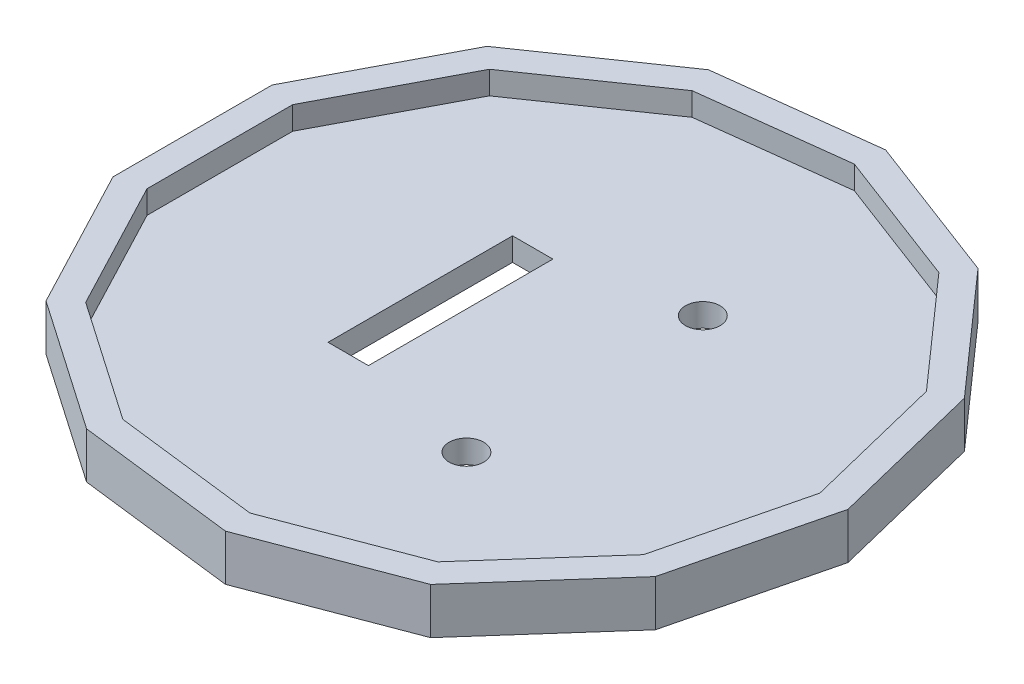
from build123d import *

# Parameters (mm, degrees)
SENSOR_BLOCK_DEPTH    = 4
SENSOR_BASE_CUT_DEPTH = 2
SKETCH9_R             = 1.5
SKETCH9_W             = 3.5
SKETCH9_H             = 16
SENSOR_HOLES_DEPTH    = 2


with BuildPart() as part:
    # Sketch5 → Sensor Block (new body)
    with BuildSketch(Plane(origin=(0, 0, 0), x_dir=(1, 0, 0), z_dir=(0, 1, 0))):
        Polygon((-21.585537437, 19.12311747), (-28, 6.901380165), (-28, -6.901380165), (-21.585537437, -19.12311747), (-10.22608838, -26.96397902), (3.476034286, -28.627717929), (16.381839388, -23.733191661), (25.534762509, -13.4016772), (28.837979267, 0), (25.534762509, 13.4016772), (16.381839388, 23.733191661), (3.476034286, 28.627717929), (-10.22608838, 26.96397902), align=None)
    extrude(amount=SENSOR_BLOCK_DEPTH)

    # Sketch7 → Sensor Base Cut (cut)
    with BuildSketch(Plane(origin=(0, 4, 0), x_dir=(1, 0, 0), z_dir=(0, 1, 0))):
        Polygon((26.4, 0), (23.376039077, 12.268691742), (14.996909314, 21.72677406), (3.182168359, 26.207514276), (-9.361569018, 24.684428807), (-19.760683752, 17.506438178), (-25.63286398, 6.317933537), (-25.63286398, -6.317933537), (-19.760683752, -17.506438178), (-9.361569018, -24.684428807), (3.182168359, -26.207514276), (14.996909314, -21.72677406), (23.376039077, -12.268691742), align=None)
    extrude(amount=-SENSOR_BASE_CUT_DEPTH, mode=Mode.SUBTRACT)

    # Sketch9 → Sensor Holes (cut)
    with BuildSketch(Plane(origin=(0, 0, 0), x_dir=(1, 0, 0), z_dir=(0, 1, 0))):
        with Locations(Location((6, 10.25, 0), (0, 0, 270))):
            Circle(SKETCH9_R)
        with Locations(Location((6, -10.25, 0), (0, 0, 90))):
            Circle(SKETCH9_R)
        with Locations((-6.5, 0)):
            Rectangle(SKETCH9_W, SKETCH9_H)
    extrude(amount=SENSOR_HOLES_DEPTH, mode=Mode.SUBTRACT)


solid = part.part
